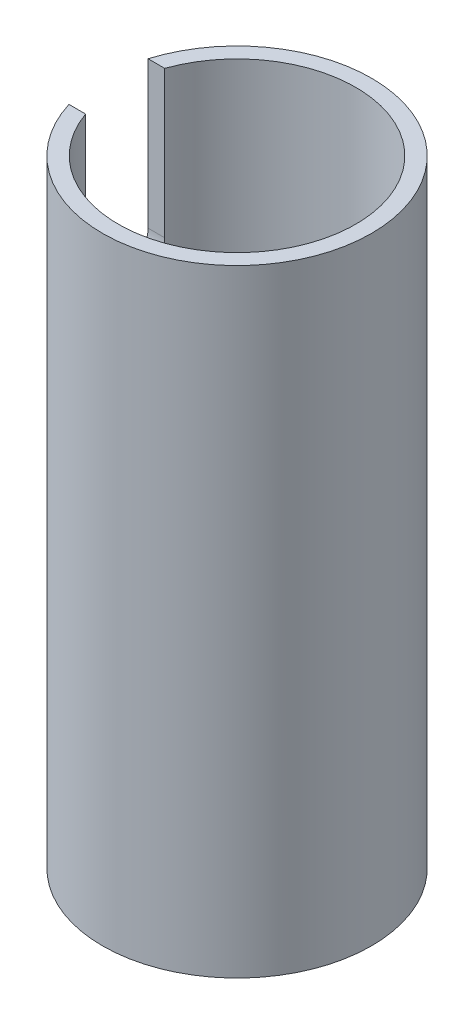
ISO-10303-21;
HEADER;
FILE_DESCRIPTION(('STEP AP214'),'2;1');
FILE_NAME('part.step','',(''),(''),'','','');
FILE_SCHEMA(('AUTOMOTIVE_DESIGN { 1 0 10303 214 1 1 1 1 }'));
ENDSEC;
DATA;
#1=APPLICATION_CONTEXT('core data for automotive mechanical design processes');
#2=APPLICATION_PROTOCOL_DEFINITION('international standard','automotive_design',2000,#1);
#3=PRODUCT_CONTEXT('',#1,'mechanical');
#4=PRODUCT('Part','Part','',(#3));
#5=PRODUCT_RELATED_PRODUCT_CATEGORY('part','',(#4));
#6=PRODUCT_DEFINITION_FORMATION('','',#4);
#7=PRODUCT_DEFINITION_CONTEXT('part definition',#1,'design');
#8=PRODUCT_DEFINITION('design','',#6,#7);
#9=PRODUCT_DEFINITION_SHAPE('','',#8);
#10=(LENGTH_UNIT() NAMED_UNIT(*) SI_UNIT(.MILLI.,.METRE.));
#11=(NAMED_UNIT(*) PLANE_ANGLE_UNIT() SI_UNIT($,.RADIAN.));
#12=(NAMED_UNIT(*) SI_UNIT($,.STERADIAN.) SOLID_ANGLE_UNIT());
#13=UNCERTAINTY_MEASURE_WITH_UNIT(LENGTH_MEASURE(1.E-05),#10,'distance_accuracy_value','');
#14=(GEOMETRIC_REPRESENTATION_CONTEXT(3) GLOBAL_UNCERTAINTY_ASSIGNED_CONTEXT((#13)) GLOBAL_UNIT_ASSIGNED_CONTEXT((#10,
#11,#12)) REPRESENTATION_CONTEXT('',''));
#15=CARTESIAN_POINT('',(0.,0.,0.));
#16=DIRECTION('',(0.,0.,1.));
#17=DIRECTION('',(1.,0.,0.));
#18=AXIS2_PLACEMENT_3D('',#15,#16,#17);
#19=CARTESIAN_POINT('',(0.,39.,0.));
#20=DIRECTION('',(0.,1.,0.));
#21=DIRECTION('',(0.,0.,1.));
#22=AXIS2_PLACEMENT_3D('',#19,#20,#21);
#23=PLANE('',#22);
#24=DIRECTION('',(-1.,0.,0.));
#25=VECTOR('',#24,1.);
#26=CARTESIAN_POINT('',(0.,39.,-2.5));
#27=LINE('',#26,#25);
#28=CARTESIAN_POINT('',(-7.07106781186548,39.,-2.5));
#29=VERTEX_POINT('',#28);
#30=CARTESIAN_POINT('',(-8.12403840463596,39.,-2.5));
#31=VERTEX_POINT('',#30);
#32=EDGE_CURVE('E57',#29,#31,#27,.T.);
#33=ORIENTED_EDGE('',*,*,#32,.F.);
#34=CARTESIAN_POINT('',(0.,39.,0.));
#35=DIRECTION('',(0.,1.,0.));
#36=DIRECTION('',(0.,0.,1.));
#37=AXIS2_PLACEMENT_3D('',#34,#35,#36);
#38=CIRCLE('',#37,7.5);
#39=CARTESIAN_POINT('',(-7.07106781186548,39.,2.49999999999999));
#40=VERTEX_POINT('',#39);
#41=EDGE_CURVE('E137',#40,#29,#38,.T.);
#42=ORIENTED_EDGE('',*,*,#41,.F.);
#43=DIRECTION('',(1.,0.,0.));
#44=VECTOR('',#43,1.);
#45=CARTESIAN_POINT('',(0.,39.,2.49999999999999));
#46=LINE('',#45,#44);
#47=CARTESIAN_POINT('',(-8.12403840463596,39.,2.49999999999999));
#48=VERTEX_POINT('',#47);
#49=EDGE_CURVE('E50',#48,#40,#46,.T.);
#50=ORIENTED_EDGE('',*,*,#49,.F.);
#51=CARTESIAN_POINT('',(0.,39.,0.));
#52=DIRECTION('',(0.,1.,0.));
#53=DIRECTION('',(0.,0.,1.));
#54=AXIS2_PLACEMENT_3D('',#51,#52,#53);
#55=CIRCLE('',#54,8.5);
#56=EDGE_CURVE('E93',#48,#31,#55,.T.);
#57=ORIENTED_EDGE('',*,*,#56,.T.);
#58=EDGE_LOOP('',(#33,#42,#50,#57));
#59=FACE_BOUND('',#58,.T.);
#60=ADVANCED_FACE('F34',(#59),#23,.T.);
#61=CARTESIAN_POINT('',(0.,0.,0.));
#62=DIRECTION('',(0.,1.,0.));
#63=DIRECTION('',(0.,0.,1.));
#64=AXIS2_PLACEMENT_3D('',#61,#62,#63);
#65=PLANE('',#64);
#66=CARTESIAN_POINT('',(0.,0.,0.));
#67=DIRECTION('',(0.,1.,0.));
#68=DIRECTION('',(0.,0.,1.));
#69=AXIS2_PLACEMENT_3D('',#66,#67,#68);
#70=CIRCLE('',#69,8.5);
#71=CARTESIAN_POINT('',(0.,0.,8.5));
#72=VERTEX_POINT('',#71);
#73=EDGE_CURVE('E132',#72,#72,#70,.T.);
#74=ORIENTED_EDGE('',*,*,#73,.F.);
#75=EDGE_LOOP('',(#74));
#76=FACE_BOUND('',#75,.T.);
#77=CARTESIAN_POINT('',(0.,0.,0.));
#78=DIRECTION('',(0.,1.,0.));
#79=DIRECTION('',(0.,0.,1.));
#80=AXIS2_PLACEMENT_3D('',#77,#78,#79);
#81=CIRCLE('',#80,7.5);
#82=CARTESIAN_POINT('',(0.,0.,7.5));
#83=VERTEX_POINT('',#82);
#84=EDGE_CURVE('E135',#83,#83,#81,.T.);
#85=ORIENTED_EDGE('',*,*,#84,.T.);
#86=EDGE_LOOP('',(#85));
#87=FACE_BOUND('',#86,.T.);
#88=ADVANCED_FACE('F122',(#76,#87),#65,.F.);
#89=CARTESIAN_POINT('',(0.,39.,0.));
#90=DIRECTION('',(0.,-1.,0.));
#91=DIRECTION('',(0.,0.,-1.));
#92=AXIS2_PLACEMENT_3D('',#89,#90,#91);
#93=CYLINDRICAL_SURFACE('',#92,8.5);
#94=CARTESIAN_POINT('',(-8.12403840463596,29.7248505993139,2.5));
#95=CARTESIAN_POINT('',(-8.12402906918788,29.6561707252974,2.50000849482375));
#96=CARTESIAN_POINT('',(-8.12490911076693,29.5874962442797,2.49717000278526));
#97=CARTESIAN_POINT('',(-8.12837858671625,29.4506700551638,2.48586511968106));
#98=CARTESIAN_POINT('',(-8.13096764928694,29.3825182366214,2.47739995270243));
#99=CARTESIAN_POINT('',(-8.13777747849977,29.2473854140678,2.4549353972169));
#100=CARTESIAN_POINT('',(-8.14199421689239,29.180401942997,2.44094966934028));
#101=CARTESIAN_POINT('',(-8.15192355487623,29.0479244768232,2.40758038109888));
#102=CARTESIAN_POINT('',(-8.15763619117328,28.982430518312,2.38819668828));
#103=CARTESIAN_POINT('',(-8.17677139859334,28.7889039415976,2.32218333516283));
#104=CARTESIAN_POINT('',(-8.19220032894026,28.6636594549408,2.26766331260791));
#105=CARTESIAN_POINT('',(-8.22665400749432,28.4240980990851,2.13928827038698));
#106=CARTESIAN_POINT('',(-8.24568033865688,28.3097860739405,2.06542473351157));
#107=CARTESIAN_POINT('',(-8.28582980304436,28.0918278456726,1.89805567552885));
#108=CARTESIAN_POINT('',(-8.30699606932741,27.9885591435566,1.80406793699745));
#109=CARTESIAN_POINT('',(-8.3486723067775,27.7989993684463,1.60015164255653));
#110=CARTESIAN_POINT('',(-8.36918216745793,27.7127111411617,1.49022042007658));
#111=CARTESIAN_POINT('',(-8.40772509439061,27.5579207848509,1.25484557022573));
#112=CARTESIAN_POINT('',(-8.4257010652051,27.4898047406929,1.12913784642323));
#113=CARTESIAN_POINT('',(-8.45664705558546,27.3758286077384,0.867439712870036));
#114=CARTESIAN_POINT('',(-8.46961832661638,27.3299629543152,0.731451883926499));
#115=CARTESIAN_POINT('',(-8.48878775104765,27.263038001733,0.457025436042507));
#116=CARTESIAN_POINT('',(-8.49516267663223,27.2413300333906,0.318757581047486));
#117=CARTESIAN_POINT('',(-8.50104290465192,27.2212874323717,0.0404023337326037));
#118=CARTESIAN_POINT('',(-8.50054945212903,27.2229485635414,-0.0996847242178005));
#119=CARTESIAN_POINT('',(-8.49287404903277,27.2491585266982,-0.373152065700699));
#120=CARTESIAN_POINT('',(-8.48589741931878,27.2730047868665,-0.506606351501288));
#121=CARTESIAN_POINT('',(-8.46628787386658,27.3417624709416,-0.7675262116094));
#122=CARTESIAN_POINT('',(-8.45365466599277,27.3866749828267,-0.894991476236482));
#123=CARTESIAN_POINT('',(-8.42386367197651,27.4967777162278,-1.14201050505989));
#124=CARTESIAN_POINT('',(-8.40665607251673,27.5621926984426,-1.26145783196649));
#125=CARTESIAN_POINT('',(-8.36954730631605,27.7112661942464,-1.48790576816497));
#126=CARTESIAN_POINT('',(-8.34964555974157,27.7949286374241,-1.59490368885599));
#127=CARTESIAN_POINT('',(-8.3084133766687,27.9817714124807,-1.79760092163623));
#128=CARTESIAN_POINT('',(-8.28705732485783,28.0855595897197,-1.89273539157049));
#129=CARTESIAN_POINT('',(-8.24596689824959,28.3078546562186,-2.06442395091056));
#130=CARTESIAN_POINT('',(-8.22623299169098,28.426365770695,-2.14097268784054));
#131=CARTESIAN_POINT('',(-8.19049726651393,28.6762023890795,-2.27388499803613));
#132=CARTESIAN_POINT('',(-8.17453234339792,28.8076380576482,-2.33005169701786));
#133=CARTESIAN_POINT('',(-8.14859211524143,29.0786078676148,-2.41922275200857));
#134=CARTESIAN_POINT('',(-8.13860768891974,29.218129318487,-2.45226239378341));
#135=CARTESIAN_POINT('',(-8.1295316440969,29.4199281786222,-2.48209216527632));
#136=CARTESIAN_POINT('',(-8.12747604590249,29.4807459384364,-2.48880708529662));
#137=CARTESIAN_POINT('',(-8.12472934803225,29.6026491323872,-2.49775684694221));
#138=CARTESIAN_POINT('',(-8.1240362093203,29.6637340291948,-2.49999838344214));
#139=CARTESIAN_POINT('',(-8.12403840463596,29.7248505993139,-2.5));
#140=B_SPLINE_CURVE_WITH_KNOTS('',3,(#94,#95,#96,#97,#98,#99,#100,#101,#102,#103,#104,#105,#106,
#107,#108,#109,#110,#111,#112,#113,#114,#115,#116,#117,#118,#119,#120,#121,#122,#123,#124,#125,
#126,#127,#128,#129,#130,#131,#132,#133,#134,#135,#136,#137,#138,#139),.UNSPECIFIED.,.F.,.F.,(4,
2,2,2,2,2,2,2,2,2,2,2,2,2,2,2,2,2,2,2,2,2,4),(0.,0.205966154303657,0.411887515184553,
0.617302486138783,0.822722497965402,1.23305966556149,1.64357781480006,2.0653304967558,
2.48715379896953,2.91733102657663,3.3474006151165,3.76562050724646,4.18376458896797,
4.58910158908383,4.99445952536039,5.40442657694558,5.81448200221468,6.23971616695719,
6.66507264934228,7.09443475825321,7.52314033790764,7.70665727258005,7.88989934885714),.UNSPECIFIED.);
#141=CARTESIAN_POINT('',(-8.12403840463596,29.7248505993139,2.5));
#142=VERTEX_POINT('',#141);
#143=CARTESIAN_POINT('',(-8.12403840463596,29.7248505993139,-2.5));
#144=VERTEX_POINT('',#143);
#145=EDGE_CURVE('E76',#142,#144,#140,.T.);
#146=ORIENTED_EDGE('',*,*,#145,.T.);
#147=DIRECTION('',(0.,-1.,0.));
#148=VECTOR('',#147,1.);
#149=CARTESIAN_POINT('',(-8.12403840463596,39.,-2.5));
#150=LINE('',#149,#148);
#151=EDGE_CURVE('E138',#144,#31,#150,.F.);
#152=ORIENTED_EDGE('',*,*,#151,.T.);
#153=ORIENTED_EDGE('',*,*,#56,.F.);
#154=DIRECTION('',(0.,-1.,0.));
#155=VECTOR('',#154,1.);
#156=CARTESIAN_POINT('',(-8.12403840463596,39.,2.49999999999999));
#157=LINE('',#156,#155);
#158=EDGE_CURVE('E85',#48,#142,#157,.T.);
#159=ORIENTED_EDGE('',*,*,#158,.T.);
#160=EDGE_LOOP('',(#146,#152,#153,#159));
#161=FACE_BOUND('',#160,.T.);
#162=ORIENTED_EDGE('',*,*,#73,.T.);
#163=EDGE_LOOP('',(#162));
#164=FACE_BOUND('',#163,.T.);
#165=ADVANCED_FACE('F36',(#161,#164),#93,.T.);
#166=CARTESIAN_POINT('',(0.,39.,0.));
#167=DIRECTION('',(0.,-1.,0.));
#168=DIRECTION('',(0.,0.,-1.));
#169=AXIS2_PLACEMENT_3D('',#166,#167,#168);
#170=CYLINDRICAL_SURFACE('',#169,7.5);
#171=DIRECTION('',(0.,-1.,0.));
#172=VECTOR('',#171,1.);
#173=CARTESIAN_POINT('',(-7.07106781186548,39.,-2.5));
#174=LINE('',#173,#172);
#175=CARTESIAN_POINT('',(-7.07106781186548,29.7248505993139,-2.5));
#176=VERTEX_POINT('',#175);
#177=EDGE_CURVE('E11',#176,#29,#174,.F.);
#178=ORIENTED_EDGE('',*,*,#177,.F.);
#179=CARTESIAN_POINT('',(-7.07106781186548,29.7248505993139,2.5));
#180=CARTESIAN_POINT('',(-7.07105693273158,29.6566435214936,2.50000899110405));
#181=CARTESIAN_POINT('',(-7.07205443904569,29.5884425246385,2.49720887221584));
#182=CARTESIAN_POINT('',(-7.07598524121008,29.4525695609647,2.4860604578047));
#183=CARTESIAN_POINT('',(-7.07891801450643,29.3848974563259,2.47771365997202));
#184=CARTESIAN_POINT('',(-7.08662705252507,29.2507601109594,2.45557459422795));
#185=CARTESIAN_POINT('',(-7.09139784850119,29.1842918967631,2.44179847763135));
#186=CARTESIAN_POINT('',(-7.10262619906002,29.0528423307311,2.4089418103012));
#187=CARTESIAN_POINT('',(-7.10908381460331,28.987861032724,2.38986106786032));
#188=CARTESIAN_POINT('',(-7.13069940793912,28.7958890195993,2.32491551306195));
#189=CARTESIAN_POINT('',(-7.14811243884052,28.6716714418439,2.2713141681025));
#190=CARTESIAN_POINT('',(-7.1869703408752,28.4339737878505,2.14517784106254));
#191=CARTESIAN_POINT('',(-7.20841768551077,28.3205003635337,2.07263123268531));
#192=CARTESIAN_POINT('',(-7.25386182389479,28.1030576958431,1.90762995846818));
#193=CARTESIAN_POINT('',(-7.27792189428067,27.9995654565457,1.81456284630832));
#194=CARTESIAN_POINT('',(-7.32534626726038,27.8093334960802,1.61247071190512));
#195=CARTESIAN_POINT('',(-7.34871044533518,27.7225967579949,1.50344285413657));
#196=CARTESIAN_POINT('',(-7.39284706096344,27.5661523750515,1.26900922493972));
#197=CARTESIAN_POINT('',(-7.41353593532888,27.4969482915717,1.1432502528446));
#198=CARTESIAN_POINT('',(-7.44924021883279,27.3808698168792,0.881073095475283));
#199=CARTESIAN_POINT('',(-7.46425736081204,27.3339886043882,0.744658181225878));
#200=CARTESIAN_POINT('',(-7.48647677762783,27.2655113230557,0.470073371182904));
#201=CARTESIAN_POINT('',(-7.49393272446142,27.2430924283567,0.332129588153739));
#202=CARTESIAN_POINT('',(-7.50109021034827,27.2215598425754,0.0542474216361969));
#203=CARTESIAN_POINT('',(-7.50079359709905,27.2224405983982,-0.0856904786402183));
#204=CARTESIAN_POINT('',(-7.49265096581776,27.2469613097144,-0.357759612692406));
#205=CARTESIAN_POINT('',(-7.48510152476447,27.2697071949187,-0.489981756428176));
#206=CARTESIAN_POINT('',(-7.46367401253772,27.3358335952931,-0.748610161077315));
#207=CARTESIAN_POINT('',(-7.44979559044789,27.3792152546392,-0.875016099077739));
#208=CARTESIAN_POINT('',(-7.41689170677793,27.4859040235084,-1.12038155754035));
#209=CARTESIAN_POINT('',(-7.39780094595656,27.5494657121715,-1.23922126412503));
#210=CARTESIAN_POINT('',(-7.35645969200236,27.6945004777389,-1.46481147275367));
#211=CARTESIAN_POINT('',(-7.33420833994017,27.7759784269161,-1.57155867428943));
#212=CARTESIAN_POINT('',(-7.28765679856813,27.9590282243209,-1.77524334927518));
#213=CARTESIAN_POINT('',(-7.26330946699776,28.0613644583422,-1.87148402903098));
#214=CARTESIAN_POINT('',(-7.21618726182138,28.2809543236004,-2.04568006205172));
#215=CARTESIAN_POINT('',(-7.19341289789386,28.398212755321,-2.12362950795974));
#216=CARTESIAN_POINT('',(-7.15175078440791,28.6465510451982,-2.26000831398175));
#217=CARTESIAN_POINT('',(-7.13292537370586,28.7778093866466,-2.31813252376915));
#218=CARTESIAN_POINT('',(-7.10202742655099,29.0489680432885,-2.41115057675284));
#219=CARTESIAN_POINT('',(-7.08994423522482,29.1888543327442,-2.4460810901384));
#220=CARTESIAN_POINT('',(-7.078413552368,29.3958971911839,-2.47914539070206));
#221=CARTESIAN_POINT('',(-7.07566669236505,29.4614540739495,-2.48696265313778));
#222=CARTESIAN_POINT('',(-7.07199258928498,29.5929457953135,-2.49738654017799));
#223=CARTESIAN_POINT('',(-7.0710629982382,29.6588800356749,-2.49999988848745));
#224=CARTESIAN_POINT('',(-7.07106781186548,29.7248505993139,-2.5));
#225=B_SPLINE_CURVE_WITH_KNOTS('',3,(#179,#180,#181,#182,#183,#184,#185,#186,#187,#188,#189,
#190,#191,#192,#193,#194,#195,#196,#197,#198,#199,#200,#201,#202,#203,#204,#205,#206,#207,#208,
#209,#210,#211,#212,#213,#214,#215,#216,#217,#218,#219,#220,#221,#222,#223,#224),.UNSPECIFIED.,
.F.,.F.,(4,2,2,2,2,2,2,2,2,2,2,2,2,2,2,2,2,2,2,2,2,2,4),(0.,0.204546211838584,0.409037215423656,
0.612924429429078,0.816819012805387,1.22401016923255,1.63145179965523,2.05327864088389,
2.47518051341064,2.90809434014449,3.34087579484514,3.75860278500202,4.17623021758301,
4.57747647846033,4.97874498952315,5.38529148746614,5.79194868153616,6.21771736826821,
6.64362337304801,7.07581676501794,7.50732520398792,7.70536340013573,7.90314555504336),.UNSPECIFIED.);
#226=CARTESIAN_POINT('',(-7.07106781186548,29.7248505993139,2.5));
#227=VERTEX_POINT('',#226);
#228=EDGE_CURVE('E43',#227,#176,#225,.T.);
#229=ORIENTED_EDGE('',*,*,#228,.F.);
#230=DIRECTION('',(0.,-1.,0.));
#231=VECTOR('',#230,1.);
#232=CARTESIAN_POINT('',(-7.07106781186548,39.,2.49999999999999));
#233=LINE('',#232,#231);
#234=EDGE_CURVE('E88',#40,#227,#233,.T.);
#235=ORIENTED_EDGE('',*,*,#234,.F.);
#236=ORIENTED_EDGE('',*,*,#41,.T.);
#237=EDGE_LOOP('',(#178,#229,#235,#236));
#238=FACE_BOUND('',#237,.T.);
#239=ORIENTED_EDGE('',*,*,#84,.F.);
#240=EDGE_LOOP('',(#239));
#241=FACE_BOUND('',#240,.T.);
#242=ADVANCED_FACE('F116',(#238,#241),#170,.F.);
#243=CARTESIAN_POINT('',(-10.,42.9482117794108,-2.50000000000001));
#244=DIRECTION('',(0.,0.,-1.));
#245=DIRECTION('',(0.,1.,0.));
#246=AXIS2_PLACEMENT_3D('',#243,#244,#245);
#247=PLANE('',#246);
#248=DIRECTION('',(1.,0.,0.));
#249=VECTOR('',#248,1.);
#250=CARTESIAN_POINT('',(-10.,29.7248505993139,-2.5));
#251=LINE('',#250,#249);
#252=EDGE_CURVE('E82',#144,#176,#251,.T.);
#253=ORIENTED_EDGE('',*,*,#252,.T.);
#254=ORIENTED_EDGE('',*,*,#177,.T.);
#255=ORIENTED_EDGE('',*,*,#32,.T.);
#256=ORIENTED_EDGE('',*,*,#151,.F.);
#257=EDGE_LOOP('',(#253,#254,#255,#256));
#258=FACE_BOUND('',#257,.T.);
#259=ADVANCED_FACE('F107',(#258),#247,.F.);
#260=CARTESIAN_POINT('',(-10.,29.7248505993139,0.));
#261=DIRECTION('',(1.,0.,0.));
#262=DIRECTION('',(0.,0.,-1.));
#263=AXIS2_PLACEMENT_3D('',#260,#261,#262);
#264=CYLINDRICAL_SURFACE('',#263,2.5);
#265=DIRECTION('',(1.,0.,0.));
#266=VECTOR('',#265,1.);
#267=CARTESIAN_POINT('',(-10.,29.7248505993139,2.5));
#268=LINE('',#267,#266);
#269=EDGE_CURVE('E79',#142,#227,#268,.T.);
#270=ORIENTED_EDGE('',*,*,#269,.T.);
#271=ORIENTED_EDGE('',*,*,#228,.T.);
#272=ORIENTED_EDGE('',*,*,#252,.F.);
#273=ORIENTED_EDGE('',*,*,#145,.F.);
#274=EDGE_LOOP('',(#270,#271,#272,#273));
#275=FACE_BOUND('',#274,.T.);
#276=ADVANCED_FACE('F78',(#275),#264,.F.);
#277=CARTESIAN_POINT('',(-10.,42.9482117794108,2.49999999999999));
#278=DIRECTION('',(0.,0.,1.));
#279=DIRECTION('',(1.,0.,0.));
#280=AXIS2_PLACEMENT_3D('',#277,#278,#279);
#281=PLANE('',#280);
#282=ORIENTED_EDGE('',*,*,#49,.T.);
#283=ORIENTED_EDGE('',*,*,#234,.T.);
#284=ORIENTED_EDGE('',*,*,#269,.F.);
#285=ORIENTED_EDGE('',*,*,#158,.F.);
#286=EDGE_LOOP('',(#282,#283,#284,#285));
#287=FACE_BOUND('',#286,.T.);
#288=ADVANCED_FACE('F87',(#287),#281,.F.);
#289=CLOSED_SHELL('',(#60,#88,#165,#242,#259,#276,#288));
#290=MANIFOLD_SOLID_BREP('B2',#289);
#291=ADVANCED_BREP_SHAPE_REPRESENTATION('',(#18,#290),#14);
#292=SHAPE_DEFINITION_REPRESENTATION(#9,#291);
ENDSEC;
END-ISO-10303-21;
